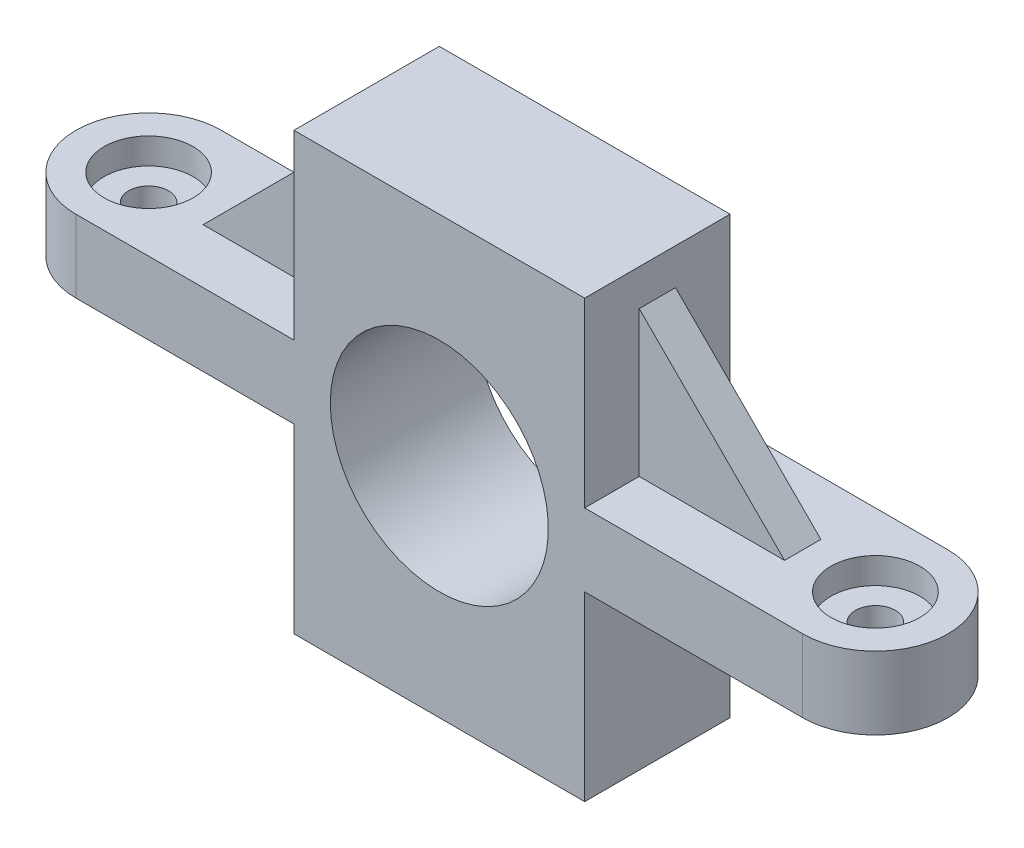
ISO-10303-21;
HEADER;
FILE_DESCRIPTION(('STEP AP214'),'2;1');
FILE_NAME('part.step','',(''),(''),'','','');
FILE_SCHEMA(('AUTOMOTIVE_DESIGN { 1 0 10303 214 1 1 1 1 }'));
ENDSEC;
DATA;
#1=APPLICATION_CONTEXT('core data for automotive mechanical design processes');
#2=APPLICATION_PROTOCOL_DEFINITION('international standard','automotive_design',2000,#1);
#3=PRODUCT_CONTEXT('',#1,'mechanical');
#4=PRODUCT('Part','Part','',(#3));
#5=PRODUCT_RELATED_PRODUCT_CATEGORY('part','',(#4));
#6=PRODUCT_DEFINITION_FORMATION('','',#4);
#7=PRODUCT_DEFINITION_CONTEXT('part definition',#1,'design');
#8=PRODUCT_DEFINITION('design','',#6,#7);
#9=PRODUCT_DEFINITION_SHAPE('','',#8);
#10=(LENGTH_UNIT() NAMED_UNIT(*) SI_UNIT(.MILLI.,.METRE.));
#11=(NAMED_UNIT(*) PLANE_ANGLE_UNIT() SI_UNIT($,.RADIAN.));
#12=(NAMED_UNIT(*) SI_UNIT($,.STERADIAN.) SOLID_ANGLE_UNIT());
#13=UNCERTAINTY_MEASURE_WITH_UNIT(LENGTH_MEASURE(1.E-05),#10,'distance_accuracy_value','');
#14=(GEOMETRIC_REPRESENTATION_CONTEXT(3) GLOBAL_UNCERTAINTY_ASSIGNED_CONTEXT((#13)) GLOBAL_UNIT_ASSIGNED_CONTEXT((#10,
#11,#12)) REPRESENTATION_CONTEXT('',''));
#15=CARTESIAN_POINT('',(0.,0.,0.));
#16=DIRECTION('',(0.,0.,1.));
#17=DIRECTION('',(1.,0.,0.));
#18=AXIS2_PLACEMENT_3D('',#15,#16,#17);
#19=CARTESIAN_POINT('',(-50.,5.,0.));
#20=DIRECTION('',(0.,-1.,0.));
#21=DIRECTION('',(0.,0.,-1.));
#22=AXIS2_PLACEMENT_3D('',#19,#20,#21);
#23=CYLINDRICAL_SURFACE('',#22,10.);
#24=DIRECTION('',(0.,-1.,0.));
#25=VECTOR('',#24,1.);
#26=CARTESIAN_POINT('',(-50.,0.,10.));
#27=LINE('',#26,#25);
#28=CARTESIAN_POINT('',(-50.,5.,10.));
#29=VERTEX_POINT('',#28);
#30=CARTESIAN_POINT('',(-50.,-5.,10.));
#31=VERTEX_POINT('',#30);
#32=EDGE_CURVE('E316',#29,#31,#27,.T.);
#33=ORIENTED_EDGE('',*,*,#32,.F.);
#34=CARTESIAN_POINT('',(-50.,5.,0.));
#35=DIRECTION('',(0.,-1.,0.));
#36=DIRECTION('',(0.,0.,-1.));
#37=AXIS2_PLACEMENT_3D('',#34,#35,#36);
#38=CIRCLE('',#37,10.);
#39=CARTESIAN_POINT('',(-50.,5.,-10.));
#40=VERTEX_POINT('',#39);
#41=EDGE_CURVE('E11',#40,#29,#38,.F.);
#42=ORIENTED_EDGE('',*,*,#41,.F.);
#43=DIRECTION('',(0.,1.,0.));
#44=VECTOR('',#43,1.);
#45=CARTESIAN_POINT('',(-50.,5.,-10.));
#46=LINE('',#45,#44);
#47=CARTESIAN_POINT('',(-50.,-5.,-10.));
#48=VERTEX_POINT('',#47);
#49=EDGE_CURVE('E41',#48,#40,#46,.T.);
#50=ORIENTED_EDGE('',*,*,#49,.F.);
#51=CARTESIAN_POINT('',(-50.,-5.,0.));
#52=DIRECTION('',(0.,-1.,0.));
#53=DIRECTION('',(0.,0.,-1.));
#54=AXIS2_PLACEMENT_3D('',#51,#52,#53);
#55=CIRCLE('',#54,10.);
#56=EDGE_CURVE('E262',#48,#31,#55,.F.);
#57=ORIENTED_EDGE('',*,*,#56,.T.);
#58=EDGE_LOOP('',(#33,#42,#50,#57));
#59=FACE_BOUND('',#58,.T.);
#60=ADVANCED_FACE('F33',(#59),#23,.T.);
#61=CARTESIAN_POINT('',(0.,0.,10.));
#62=DIRECTION('',(0.,0.,-1.));
#63=DIRECTION('',(-1.,0.,0.));
#64=AXIS2_PLACEMENT_3D('',#61,#62,#63);
#65=CYLINDRICAL_SURFACE('',#64,15.);
#66=CARTESIAN_POINT('',(0.,0.,10.));
#67=DIRECTION('',(0.,0.,-1.));
#68=DIRECTION('',(-1.,0.,0.));
#69=AXIS2_PLACEMENT_3D('',#66,#67,#68);
#70=CIRCLE('',#69,15.);
#71=CARTESIAN_POINT('',(-15.,0.,10.));
#72=VERTEX_POINT('',#71);
#73=EDGE_CURVE('E301',#72,#72,#70,.T.);
#74=ORIENTED_EDGE('',*,*,#73,.F.);
#75=EDGE_LOOP('',(#74));
#76=FACE_BOUND('',#75,.T.);
#77=CARTESIAN_POINT('',(0.,0.,-10.));
#78=DIRECTION('',(0.,0.,-1.));
#79=DIRECTION('',(-1.,0.,0.));
#80=AXIS2_PLACEMENT_3D('',#77,#78,#79);
#81=CIRCLE('',#80,15.);
#82=CARTESIAN_POINT('',(-15.,0.,-10.));
#83=VERTEX_POINT('',#82);
#84=EDGE_CURVE('E289',#83,#83,#81,.T.);
#85=ORIENTED_EDGE('',*,*,#84,.T.);
#86=EDGE_LOOP('',(#85));
#87=FACE_BOUND('',#86,.T.);
#88=ADVANCED_FACE('F410',(#76,#87),#65,.F.);
#89=CARTESIAN_POINT('',(-20.,30.,10.));
#90=DIRECTION('',(0.,-1.,0.));
#91=DIRECTION('',(0.,0.,-1.));
#92=AXIS2_PLACEMENT_3D('',#89,#90,#91);
#93=PLANE('',#92);
#94=DIRECTION('',(0.,0.,-1.));
#95=VECTOR('',#94,1.);
#96=CARTESIAN_POINT('',(20.,30.,10.));
#97=LINE('',#96,#95);
#98=CARTESIAN_POINT('',(20.,30.,10.));
#99=VERTEX_POINT('',#98);
#100=CARTESIAN_POINT('',(20.,30.,-10.));
#101=VERTEX_POINT('',#100);
#102=EDGE_CURVE('E279',#99,#101,#97,.T.);
#103=ORIENTED_EDGE('',*,*,#102,.T.);
#104=DIRECTION('',(-1.,0.,0.));
#105=VECTOR('',#104,1.);
#106=CARTESIAN_POINT('',(-20.,30.,-10.));
#107=LINE('',#106,#105);
#108=CARTESIAN_POINT('',(-20.,30.,-10.));
#109=VERTEX_POINT('',#108);
#110=EDGE_CURVE('E292',#101,#109,#107,.T.);
#111=ORIENTED_EDGE('',*,*,#110,.T.);
#112=DIRECTION('',(0.,0.,-1.));
#113=VECTOR('',#112,1.);
#114=CARTESIAN_POINT('',(-20.,30.,10.));
#115=LINE('',#114,#113);
#116=CARTESIAN_POINT('',(-20.,30.,10.));
#117=VERTEX_POINT('',#116);
#118=EDGE_CURVE('E314',#117,#109,#115,.T.);
#119=ORIENTED_EDGE('',*,*,#118,.F.);
#120=DIRECTION('',(-1.,0.,0.));
#121=VECTOR('',#120,1.);
#122=CARTESIAN_POINT('',(-20.,30.,10.));
#123=LINE('',#122,#121);
#124=EDGE_CURVE('E304',#99,#117,#123,.T.);
#125=ORIENTED_EDGE('',*,*,#124,.F.);
#126=EDGE_LOOP('',(#103,#111,#119,#125));
#127=FACE_BOUND('',#126,.T.);
#128=ADVANCED_FACE('F386',(#127),#93,.F.);
#129=CARTESIAN_POINT('',(-20.,5.,10.));
#130=DIRECTION('',(1.,0.,0.));
#131=DIRECTION('',(0.,1.,0.));
#132=AXIS2_PLACEMENT_3D('',#129,#130,#131);
#133=PLANE('',#132);
#134=DIRECTION('',(0.,0.,1.));
#135=VECTOR('',#134,1.);
#136=CARTESIAN_POINT('',(-20.,25.0000000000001,10.));
#137=LINE('',#136,#135);
#138=CARTESIAN_POINT('',(-20.,25.0000000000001,-2.5));
#139=VERTEX_POINT('',#138);
#140=CARTESIAN_POINT('',(-20.,25.0000000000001,2.5));
#141=VERTEX_POINT('',#140);
#142=EDGE_CURVE('E49',#139,#141,#137,.T.);
#143=ORIENTED_EDGE('',*,*,#142,.T.);
#144=DIRECTION('',(0.,-1.,0.));
#145=VECTOR('',#144,1.);
#146=CARTESIAN_POINT('',(-20.,5.,2.5));
#147=LINE('',#146,#145);
#148=CARTESIAN_POINT('',(-20.,5.,2.5));
#149=VERTEX_POINT('',#148);
#150=EDGE_CURVE('E167',#141,#149,#147,.T.);
#151=ORIENTED_EDGE('',*,*,#150,.T.);
#152=DIRECTION('',(0.,0.,-1.));
#153=VECTOR('',#152,1.);
#154=CARTESIAN_POINT('',(-20.,5.,10.));
#155=LINE('',#154,#153);
#156=CARTESIAN_POINT('',(-20.,5.,10.));
#157=VERTEX_POINT('',#156);
#158=EDGE_CURVE('E312',#157,#149,#155,.T.);
#159=ORIENTED_EDGE('',*,*,#158,.F.);
#160=DIRECTION('',(0.,-1.,0.));
#161=VECTOR('',#160,1.);
#162=CARTESIAN_POINT('',(-20.,5.,10.));
#163=LINE('',#162,#161);
#164=EDGE_CURVE('E306',#117,#157,#163,.T.);
#165=ORIENTED_EDGE('',*,*,#164,.F.);
#166=ORIENTED_EDGE('',*,*,#118,.T.);
#167=DIRECTION('',(0.,-1.,0.));
#168=VECTOR('',#167,1.);
#169=CARTESIAN_POINT('',(-20.,5.,-10.));
#170=LINE('',#169,#168);
#171=CARTESIAN_POINT('',(-20.,5.,-10.));
#172=VERTEX_POINT('',#171);
#173=EDGE_CURVE('E295',#109,#172,#170,.T.);
#174=ORIENTED_EDGE('',*,*,#173,.T.);
#175=CARTESIAN_POINT('',(-20.,5.,-2.5));
#176=VERTEX_POINT('',#175);
#177=EDGE_CURVE('E311',#176,#172,#155,.T.);
#178=ORIENTED_EDGE('',*,*,#177,.F.);
#179=DIRECTION('',(0.,-1.,0.));
#180=VECTOR('',#179,1.);
#181=CARTESIAN_POINT('',(-20.,5.,-2.5));
#182=LINE('',#181,#180);
#183=EDGE_CURVE('E54',#139,#176,#182,.T.);
#184=ORIENTED_EDGE('',*,*,#183,.F.);
#185=EDGE_LOOP('',(#143,#151,#159,#165,#166,#174,#178,#184));
#186=FACE_BOUND('',#185,.T.);
#187=ADVANCED_FACE('F388',(#186),#133,.F.);
#188=CARTESIAN_POINT('',(-60.,5.,10.));
#189=DIRECTION('',(0.,-1.,0.));
#190=DIRECTION('',(0.,0.,-1.));
#191=AXIS2_PLACEMENT_3D('',#188,#189,#190);
#192=PLANE('',#191);
#193=CARTESIAN_POINT('',(-50.,4.99999999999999,0.));
#194=DIRECTION('',(0.,1.,0.));
#195=DIRECTION('',(0.,0.,1.));
#196=AXIS2_PLACEMENT_3D('',#193,#194,#195);
#197=CIRCLE('',#196,6.12);
#198=CARTESIAN_POINT('',(-50.,4.99999999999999,6.12));
#199=VERTEX_POINT('',#198);
#200=EDGE_CURVE('E183',#199,#199,#197,.T.);
#201=ORIENTED_EDGE('',*,*,#200,.F.);
#202=EDGE_LOOP('',(#201));
#203=FACE_BOUND('',#202,.T.);
#204=ORIENTED_EDGE('',*,*,#158,.T.);
#205=DIRECTION('',(-1.,0.,0.));
#206=VECTOR('',#205,1.);
#207=CARTESIAN_POINT('',(-60.,5.,2.5));
#208=LINE('',#207,#206);
#209=CARTESIAN_POINT('',(-40.,5.,2.5));
#210=VERTEX_POINT('',#209);
#211=EDGE_CURVE('E162',#149,#210,#208,.T.);
#212=ORIENTED_EDGE('',*,*,#211,.T.);
#213=DIRECTION('',(0.,0.,-1.));
#214=VECTOR('',#213,1.);
#215=CARTESIAN_POINT('',(-40.,5.,10.));
#216=LINE('',#215,#214);
#217=CARTESIAN_POINT('',(-40.,5.,-2.5));
#218=VERTEX_POINT('',#217);
#219=EDGE_CURVE('E156',#210,#218,#216,.T.);
#220=ORIENTED_EDGE('',*,*,#219,.T.);
#221=DIRECTION('',(-1.,0.,0.));
#222=VECTOR('',#221,1.);
#223=CARTESIAN_POINT('',(-60.,5.,-2.5));
#224=LINE('',#223,#222);
#225=EDGE_CURVE('E160',#176,#218,#224,.T.);
#226=ORIENTED_EDGE('',*,*,#225,.F.);
#227=ORIENTED_EDGE('',*,*,#177,.T.);
#228=DIRECTION('',(-1.,0.,0.));
#229=VECTOR('',#228,1.);
#230=CARTESIAN_POINT('',(-60.,5.,-10.));
#231=LINE('',#230,#229);
#232=EDGE_CURVE('E298',#172,#40,#231,.T.);
#233=ORIENTED_EDGE('',*,*,#232,.T.);
#234=ORIENTED_EDGE('',*,*,#41,.T.);
#235=DIRECTION('',(-1.,0.,0.));
#236=VECTOR('',#235,1.);
#237=CARTESIAN_POINT('',(-60.,5.,10.));
#238=LINE('',#237,#236);
#239=EDGE_CURVE('E308',#157,#29,#238,.T.);
#240=ORIENTED_EDGE('',*,*,#239,.F.);
#241=EDGE_LOOP('',(#204,#212,#220,#226,#227,#233,#234,#240));
#242=FACE_BOUND('',#241,.T.);
#243=ADVANCED_FACE('F159',(#203,#242),#192,.F.);
#244=CARTESIAN_POINT('',(0.,0.,10.));
#245=DIRECTION('',(0.,0.,-1.));
#246=DIRECTION('',(-1.,0.,0.));
#247=AXIS2_PLACEMENT_3D('',#244,#245,#246);
#248=PLANE('',#247);
#249=ORIENTED_EDGE('',*,*,#73,.T.);
#250=EDGE_LOOP('',(#249));
#251=FACE_BOUND('',#250,.T.);
#252=ORIENTED_EDGE('',*,*,#239,.T.);
#253=ORIENTED_EDGE('',*,*,#32,.T.);
#254=DIRECTION('',(-1.,0.,0.));
#255=VECTOR('',#254,1.);
#256=CARTESIAN_POINT('',(-60.,-5.,10.));
#257=LINE('',#256,#255);
#258=CARTESIAN_POINT('',(-20.,-5.,10.));
#259=VERTEX_POINT('',#258);
#260=EDGE_CURVE('E255',#259,#31,#257,.T.);
#261=ORIENTED_EDGE('',*,*,#260,.F.);
#262=DIRECTION('',(0.,1.,0.));
#263=VECTOR('',#262,1.);
#264=CARTESIAN_POINT('',(-20.,-5.,10.));
#265=LINE('',#264,#263);
#266=CARTESIAN_POINT('',(-20.,-30.,10.));
#267=VERTEX_POINT('',#266);
#268=EDGE_CURVE('E252',#267,#259,#265,.T.);
#269=ORIENTED_EDGE('',*,*,#268,.F.);
#270=DIRECTION('',(-1.,0.,0.));
#271=VECTOR('',#270,1.);
#272=CARTESIAN_POINT('',(-20.,-30.,10.));
#273=LINE('',#272,#271);
#274=CARTESIAN_POINT('',(20.,-30.,10.));
#275=VERTEX_POINT('',#274);
#276=EDGE_CURVE('E249',#275,#267,#273,.T.);
#277=ORIENTED_EDGE('',*,*,#276,.F.);
#278=DIRECTION('',(0.,1.,0.));
#279=VECTOR('',#278,1.);
#280=CARTESIAN_POINT('',(20.,-5.,10.));
#281=LINE('',#280,#279);
#282=CARTESIAN_POINT('',(20.,-5.,10.));
#283=VERTEX_POINT('',#282);
#284=EDGE_CURVE('E228',#275,#283,#281,.T.);
#285=ORIENTED_EDGE('',*,*,#284,.T.);
#286=DIRECTION('',(1.,0.,0.));
#287=VECTOR('',#286,1.);
#288=CARTESIAN_POINT('',(60.,-5.00000000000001,10.));
#289=LINE('',#288,#287);
#290=CARTESIAN_POINT('',(50.,-5.00000000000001,10.));
#291=VERTEX_POINT('',#290);
#292=EDGE_CURVE('E231',#283,#291,#289,.T.);
#293=ORIENTED_EDGE('',*,*,#292,.T.);
#294=DIRECTION('',(0.,-1.,0.));
#295=VECTOR('',#294,1.);
#296=CARTESIAN_POINT('',(50.,0.,10.));
#297=LINE('',#296,#295);
#298=CARTESIAN_POINT('',(50.,5.00000000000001,10.));
#299=VERTEX_POINT('',#298);
#300=EDGE_CURVE('E281',#299,#291,#297,.T.);
#301=ORIENTED_EDGE('',*,*,#300,.F.);
#302=DIRECTION('',(1.,0.,0.));
#303=VECTOR('',#302,1.);
#304=CARTESIAN_POINT('',(60.,5.00000000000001,10.));
#305=LINE('',#304,#303);
#306=CARTESIAN_POINT('',(20.,5.,10.));
#307=VERTEX_POINT('',#306);
#308=EDGE_CURVE('E272',#307,#299,#305,.T.);
#309=ORIENTED_EDGE('',*,*,#308,.F.);
#310=DIRECTION('',(0.,-1.,0.));
#311=VECTOR('',#310,1.);
#312=CARTESIAN_POINT('',(20.,5.,10.));
#313=LINE('',#312,#311);
#314=EDGE_CURVE('E269',#99,#307,#313,.T.);
#315=ORIENTED_EDGE('',*,*,#314,.F.);
#316=ORIENTED_EDGE('',*,*,#124,.T.);
#317=ORIENTED_EDGE('',*,*,#164,.T.);
#318=EDGE_LOOP('',(#252,#253,#261,#269,#277,#285,#293,#301,#309,#315,#316,#317));
#319=FACE_BOUND('',#318,.T.);
#320=ADVANCED_FACE('F357',(#251,#319),#248,.F.);
#321=CARTESIAN_POINT('',(0.,0.,-10.));
#322=DIRECTION('',(0.,0.,-1.));
#323=DIRECTION('',(-1.,0.,0.));
#324=AXIS2_PLACEMENT_3D('',#321,#322,#323);
#325=PLANE('',#324);
#326=ORIENTED_EDGE('',*,*,#84,.F.);
#327=EDGE_LOOP('',(#326));
#328=FACE_BOUND('',#327,.T.);
#329=DIRECTION('',(-1.,0.,0.));
#330=VECTOR('',#329,1.);
#331=CARTESIAN_POINT('',(-60.,-5.,-10.));
#332=LINE('',#331,#330);
#333=CARTESIAN_POINT('',(-20.,-5.,-10.));
#334=VERTEX_POINT('',#333);
#335=EDGE_CURVE('E246',#334,#48,#332,.T.);
#336=ORIENTED_EDGE('',*,*,#335,.T.);
#337=ORIENTED_EDGE('',*,*,#49,.T.);
#338=ORIENTED_EDGE('',*,*,#232,.F.);
#339=ORIENTED_EDGE('',*,*,#173,.F.);
#340=ORIENTED_EDGE('',*,*,#110,.F.);
#341=DIRECTION('',(0.,-1.,0.));
#342=VECTOR('',#341,1.);
#343=CARTESIAN_POINT('',(20.,5.,-10.));
#344=LINE('',#343,#342);
#345=CARTESIAN_POINT('',(20.,5.,-10.));
#346=VERTEX_POINT('',#345);
#347=EDGE_CURVE('E264',#101,#346,#344,.T.);
#348=ORIENTED_EDGE('',*,*,#347,.T.);
#349=DIRECTION('',(1.,0.,0.));
#350=VECTOR('',#349,1.);
#351=CARTESIAN_POINT('',(60.,5.00000000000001,-10.));
#352=LINE('',#351,#350);
#353=CARTESIAN_POINT('',(50.,5.00000000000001,-10.));
#354=VERTEX_POINT('',#353);
#355=EDGE_CURVE('E267',#346,#354,#352,.T.);
#356=ORIENTED_EDGE('',*,*,#355,.T.);
#357=DIRECTION('',(0.,1.,0.));
#358=VECTOR('',#357,1.);
#359=CARTESIAN_POINT('',(50.,5.00000000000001,-10.));
#360=LINE('',#359,#358);
#361=CARTESIAN_POINT('',(50.,-5.00000000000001,-10.));
#362=VERTEX_POINT('',#361);
#363=EDGE_CURVE('E284',#362,#354,#360,.T.);
#364=ORIENTED_EDGE('',*,*,#363,.F.);
#365=DIRECTION('',(1.,0.,0.));
#366=VECTOR('',#365,1.);
#367=CARTESIAN_POINT('',(60.,-5.00000000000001,-10.));
#368=LINE('',#367,#366);
#369=CARTESIAN_POINT('',(20.,-5.,-10.));
#370=VERTEX_POINT('',#369);
#371=EDGE_CURVE('E225',#370,#362,#368,.T.);
#372=ORIENTED_EDGE('',*,*,#371,.F.);
#373=DIRECTION('',(0.,1.,0.));
#374=VECTOR('',#373,1.);
#375=CARTESIAN_POINT('',(20.,-5.,-10.));
#376=LINE('',#375,#374);
#377=CARTESIAN_POINT('',(20.,-30.,-10.));
#378=VERTEX_POINT('',#377);
#379=EDGE_CURVE('E222',#378,#370,#376,.T.);
#380=ORIENTED_EDGE('',*,*,#379,.F.);
#381=DIRECTION('',(-1.,0.,0.));
#382=VECTOR('',#381,1.);
#383=CARTESIAN_POINT('',(-20.,-30.,-10.));
#384=LINE('',#383,#382);
#385=CARTESIAN_POINT('',(-20.,-30.,-10.));
#386=VERTEX_POINT('',#385);
#387=EDGE_CURVE('E240',#378,#386,#384,.T.);
#388=ORIENTED_EDGE('',*,*,#387,.T.);
#389=DIRECTION('',(0.,1.,0.));
#390=VECTOR('',#389,1.);
#391=CARTESIAN_POINT('',(-20.,-5.,-10.));
#392=LINE('',#391,#390);
#393=EDGE_CURVE('E243',#386,#334,#392,.T.);
#394=ORIENTED_EDGE('',*,*,#393,.T.);
#395=EDGE_LOOP('',(#336,#337,#338,#339,#340,#348,#356,#364,#372,#380,#388,#394));
#396=FACE_BOUND('',#395,.T.);
#397=ADVANCED_FACE('F364',(#328,#396),#325,.T.);
#398=CARTESIAN_POINT('',(50.,5.00000000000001,0.));
#399=DIRECTION('',(0.,-1.,0.));
#400=DIRECTION('',(0.,0.,-1.));
#401=AXIS2_PLACEMENT_3D('',#398,#399,#400);
#402=CYLINDRICAL_SURFACE('',#401,10.);
#403=ORIENTED_EDGE('',*,*,#300,.T.);
#404=CARTESIAN_POINT('',(50.,-5.00000000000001,0.));
#405=DIRECTION('',(0.,1.,0.));
#406=DIRECTION('',(0.,0.,-1.));
#407=AXIS2_PLACEMENT_3D('',#404,#405,#406);
#408=CIRCLE('',#407,10.);
#409=EDGE_CURVE('E238',#362,#291,#408,.F.);
#410=ORIENTED_EDGE('',*,*,#409,.F.);
#411=ORIENTED_EDGE('',*,*,#363,.T.);
#412=CARTESIAN_POINT('',(50.,5.00000000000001,0.));
#413=DIRECTION('',(0.,1.,0.));
#414=DIRECTION('',(0.,0.,-1.));
#415=AXIS2_PLACEMENT_3D('',#412,#413,#414);
#416=CIRCLE('',#415,10.);
#417=EDGE_CURVE('E287',#354,#299,#416,.F.);
#418=ORIENTED_EDGE('',*,*,#417,.T.);
#419=EDGE_LOOP('',(#403,#410,#411,#418));
#420=FACE_BOUND('',#419,.T.);
#421=ADVANCED_FACE('F361',(#420),#402,.T.);
#422=CARTESIAN_POINT('',(20.,5.,10.));
#423=DIRECTION('',(-1.,0.,0.));
#424=DIRECTION('',(0.,1.,0.));
#425=AXIS2_PLACEMENT_3D('',#422,#423,#424);
#426=PLANE('',#425);
#427=DIRECTION('',(0.,1.,0.));
#428=VECTOR('',#427,1.);
#429=CARTESIAN_POINT('',(20.,5.,2.5));
#430=LINE('',#429,#428);
#431=CARTESIAN_POINT('',(20.,5.,2.5));
#432=VERTEX_POINT('',#431);
#433=CARTESIAN_POINT('',(20.,25.0000000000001,2.5));
#434=VERTEX_POINT('',#433);
#435=EDGE_CURVE('E206',#432,#434,#430,.T.);
#436=ORIENTED_EDGE('',*,*,#435,.T.);
#437=DIRECTION('',(0.,0.,1.));
#438=VECTOR('',#437,1.);
#439=CARTESIAN_POINT('',(20.,25.0000000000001,10.));
#440=LINE('',#439,#438);
#441=CARTESIAN_POINT('',(20.,25.0000000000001,-2.5));
#442=VERTEX_POINT('',#441);
#443=EDGE_CURVE('E210',#434,#442,#440,.F.);
#444=ORIENTED_EDGE('',*,*,#443,.T.);
#445=DIRECTION('',(0.,1.,0.));
#446=VECTOR('',#445,1.);
#447=CARTESIAN_POINT('',(20.,5.,-2.5));
#448=LINE('',#447,#446);
#449=CARTESIAN_POINT('',(20.,5.,-2.5));
#450=VERTEX_POINT('',#449);
#451=EDGE_CURVE('E201',#450,#442,#448,.T.);
#452=ORIENTED_EDGE('',*,*,#451,.F.);
#453=DIRECTION('',(0.,0.,-1.));
#454=VECTOR('',#453,1.);
#455=CARTESIAN_POINT('',(20.,5.,10.));
#456=LINE('',#455,#454);
#457=EDGE_CURVE('E275',#450,#346,#456,.T.);
#458=ORIENTED_EDGE('',*,*,#457,.T.);
#459=ORIENTED_EDGE('',*,*,#347,.F.);
#460=ORIENTED_EDGE('',*,*,#102,.F.);
#461=ORIENTED_EDGE('',*,*,#314,.T.);
#462=EDGE_CURVE('E276',#307,#432,#456,.T.);
#463=ORIENTED_EDGE('',*,*,#462,.T.);
#464=EDGE_LOOP('',(#436,#444,#452,#458,#459,#460,#461,#463));
#465=FACE_BOUND('',#464,.T.);
#466=ADVANCED_FACE('F349',(#465),#426,.F.);
#467=CARTESIAN_POINT('',(60.,5.00000000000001,10.));
#468=DIRECTION('',(0.,-1.,0.));
#469=DIRECTION('',(0.,0.,-1.));
#470=AXIS2_PLACEMENT_3D('',#467,#468,#469);
#471=PLANE('',#470);
#472=CARTESIAN_POINT('',(50.,4.99999999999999,0.));
#473=DIRECTION('',(0.,1.,0.));
#474=DIRECTION('',(0.,0.,1.));
#475=AXIS2_PLACEMENT_3D('',#472,#473,#474);
#476=CIRCLE('',#475,6.12);
#477=CARTESIAN_POINT('',(50.,4.99999999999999,6.12));
#478=VERTEX_POINT('',#477);
#479=EDGE_CURVE('E212',#478,#478,#476,.T.);
#480=ORIENTED_EDGE('',*,*,#479,.F.);
#481=EDGE_LOOP('',(#480));
#482=FACE_BOUND('',#481,.T.);
#483=ORIENTED_EDGE('',*,*,#308,.T.);
#484=ORIENTED_EDGE('',*,*,#417,.F.);
#485=ORIENTED_EDGE('',*,*,#355,.F.);
#486=ORIENTED_EDGE('',*,*,#457,.F.);
#487=DIRECTION('',(-1.,0.,0.));
#488=VECTOR('',#487,1.);
#489=CARTESIAN_POINT('',(60.,5.00000000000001,-2.5));
#490=LINE('',#489,#488);
#491=CARTESIAN_POINT('',(40.,5.00000000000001,-2.5));
#492=VERTEX_POINT('',#491);
#493=EDGE_CURVE('E198',#492,#450,#490,.T.);
#494=ORIENTED_EDGE('',*,*,#493,.F.);
#495=DIRECTION('',(0.,0.,-1.));
#496=VECTOR('',#495,1.);
#497=CARTESIAN_POINT('',(40.,5.00000000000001,10.));
#498=LINE('',#497,#496);
#499=CARTESIAN_POINT('',(40.,5.00000000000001,2.5));
#500=VERTEX_POINT('',#499);
#501=EDGE_CURVE('E208',#492,#500,#498,.F.);
#502=ORIENTED_EDGE('',*,*,#501,.T.);
#503=DIRECTION('',(-1.,0.,0.));
#504=VECTOR('',#503,1.);
#505=CARTESIAN_POINT('',(60.,5.00000000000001,2.5));
#506=LINE('',#505,#504);
#507=EDGE_CURVE('E204',#500,#432,#506,.T.);
#508=ORIENTED_EDGE('',*,*,#507,.T.);
#509=ORIENTED_EDGE('',*,*,#462,.F.);
#510=EDGE_LOOP('',(#483,#484,#485,#486,#494,#502,#508,#509));
#511=FACE_BOUND('',#510,.T.);
#512=ADVANCED_FACE('F345',(#482,#511),#471,.F.);
#513=CARTESIAN_POINT('',(-20.,-30.,10.));
#514=DIRECTION('',(0.,1.,0.));
#515=DIRECTION('',(0.,0.,-1.));
#516=AXIS2_PLACEMENT_3D('',#513,#514,#515);
#517=PLANE('',#516);
#518=DIRECTION('',(0.,0.,-1.));
#519=VECTOR('',#518,1.);
#520=CARTESIAN_POINT('',(-20.,-30.,10.));
#521=LINE('',#520,#519);
#522=EDGE_CURVE('E260',#267,#386,#521,.T.);
#523=ORIENTED_EDGE('',*,*,#522,.T.);
#524=ORIENTED_EDGE('',*,*,#387,.F.);
#525=DIRECTION('',(0.,0.,-1.));
#526=VECTOR('',#525,1.);
#527=CARTESIAN_POINT('',(20.,-30.,10.));
#528=LINE('',#527,#526);
#529=EDGE_CURVE('E236',#275,#378,#528,.T.);
#530=ORIENTED_EDGE('',*,*,#529,.F.);
#531=ORIENTED_EDGE('',*,*,#276,.T.);
#532=EDGE_LOOP('',(#523,#524,#530,#531));
#533=FACE_BOUND('',#532,.T.);
#534=ADVANCED_FACE('F348',(#533),#517,.F.);
#535=CARTESIAN_POINT('',(-20.,-5.,10.));
#536=DIRECTION('',(1.,0.,0.));
#537=DIRECTION('',(0.,-1.,0.));
#538=AXIS2_PLACEMENT_3D('',#535,#536,#537);
#539=PLANE('',#538);
#540=DIRECTION('',(0.,0.,-1.));
#541=VECTOR('',#540,1.);
#542=CARTESIAN_POINT('',(-20.,-5.,10.));
#543=LINE('',#542,#541);
#544=EDGE_CURVE('E258',#259,#334,#543,.T.);
#545=ORIENTED_EDGE('',*,*,#544,.T.);
#546=ORIENTED_EDGE('',*,*,#393,.F.);
#547=ORIENTED_EDGE('',*,*,#522,.F.);
#548=ORIENTED_EDGE('',*,*,#268,.T.);
#549=EDGE_LOOP('',(#545,#546,#547,#548));
#550=FACE_BOUND('',#549,.T.);
#551=ADVANCED_FACE('F401',(#550),#539,.F.);
#552=CARTESIAN_POINT('',(-60.,-5.,10.));
#553=DIRECTION('',(0.,1.,0.));
#554=DIRECTION('',(0.,0.,-1.));
#555=AXIS2_PLACEMENT_3D('',#552,#553,#554);
#556=PLANE('',#555);
#557=ORIENTED_EDGE('',*,*,#335,.F.);
#558=ORIENTED_EDGE('',*,*,#544,.F.);
#559=ORIENTED_EDGE('',*,*,#260,.T.);
#560=ORIENTED_EDGE('',*,*,#56,.F.);
#561=EDGE_LOOP('',(#557,#558,#559,#560));
#562=FACE_BOUND('',#561,.T.);
#563=CARTESIAN_POINT('',(-50.,-5.,0.));
#564=DIRECTION('',(0.,1.,0.));
#565=DIRECTION('',(0.,0.,1.));
#566=AXIS2_PLACEMENT_3D('',#563,#564,#565);
#567=CIRCLE('',#566,2.75);
#568=CARTESIAN_POINT('',(-50.,-5.,2.75));
#569=VERTEX_POINT('',#568);
#570=EDGE_CURVE('E36',#569,#569,#567,.T.);
#571=ORIENTED_EDGE('',*,*,#570,.T.);
#572=EDGE_LOOP('',(#571));
#573=FACE_BOUND('',#572,.T.);
#574=ADVANCED_FACE('F396',(#562,#573),#556,.F.);
#575=CARTESIAN_POINT('',(20.,-5.,10.));
#576=DIRECTION('',(-1.,0.,0.));
#577=DIRECTION('',(0.,-1.,0.));
#578=AXIS2_PLACEMENT_3D('',#575,#576,#577);
#579=PLANE('',#578);
#580=ORIENTED_EDGE('',*,*,#529,.T.);
#581=ORIENTED_EDGE('',*,*,#379,.T.);
#582=DIRECTION('',(0.,0.,-1.));
#583=VECTOR('',#582,1.);
#584=CARTESIAN_POINT('',(20.,-5.,10.));
#585=LINE('',#584,#583);
#586=EDGE_CURVE('E234',#283,#370,#585,.T.);
#587=ORIENTED_EDGE('',*,*,#586,.F.);
#588=ORIENTED_EDGE('',*,*,#284,.F.);
#589=EDGE_LOOP('',(#580,#581,#587,#588));
#590=FACE_BOUND('',#589,.T.);
#591=ADVANCED_FACE('F407',(#590),#579,.F.);
#592=CARTESIAN_POINT('',(60.,-5.00000000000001,10.));
#593=DIRECTION('',(0.,1.,0.));
#594=DIRECTION('',(0.,0.,-1.));
#595=AXIS2_PLACEMENT_3D('',#592,#593,#594);
#596=PLANE('',#595);
#597=CARTESIAN_POINT('',(50.,-5.00000000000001,0.));
#598=DIRECTION('',(0.,1.,0.));
#599=DIRECTION('',(-1.,0.,0.));
#600=AXIS2_PLACEMENT_3D('',#597,#598,#599);
#601=CIRCLE('',#600,2.75);
#602=CARTESIAN_POINT('',(47.25,-5.00000000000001,0.));
#603=VERTEX_POINT('',#602);
#604=EDGE_CURVE('E221',#603,#603,#601,.T.);
#605=ORIENTED_EDGE('',*,*,#604,.T.);
#606=EDGE_LOOP('',(#605));
#607=FACE_BOUND('',#606,.T.);
#608=ORIENTED_EDGE('',*,*,#586,.T.);
#609=ORIENTED_EDGE('',*,*,#371,.T.);
#610=ORIENTED_EDGE('',*,*,#409,.T.);
#611=ORIENTED_EDGE('',*,*,#292,.F.);
#612=EDGE_LOOP('',(#608,#609,#610,#611));
#613=FACE_BOUND('',#612,.T.);
#614=ADVANCED_FACE('F323',(#607,#613),#596,.F.);
#615=CARTESIAN_POINT('',(50.,4.99999999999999,0.));
#616=DIRECTION('',(0.,1.,0.));
#617=DIRECTION('',(0.,0.,1.));
#618=AXIS2_PLACEMENT_3D('',#615,#616,#617);
#619=CYLINDRICAL_SURFACE('',#618,2.75);
#620=ORIENTED_EDGE('',*,*,#604,.F.);
#621=EDGE_LOOP('',(#620));
#622=FACE_BOUND('',#621,.T.);
#623=CARTESIAN_POINT('',(50.,1.41999999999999,0.));
#624=DIRECTION('',(0.,1.,0.));
#625=DIRECTION('',(0.,0.,1.));
#626=AXIS2_PLACEMENT_3D('',#623,#624,#625);
#627=CIRCLE('',#626,2.75000000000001);
#628=CARTESIAN_POINT('',(50.,1.41999999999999,2.75000000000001));
#629=VERTEX_POINT('',#628);
#630=EDGE_CURVE('E218',#629,#629,#627,.T.);
#631=ORIENTED_EDGE('',*,*,#630,.T.);
#632=EDGE_LOOP('',(#631));
#633=FACE_BOUND('',#632,.T.);
#634=ADVANCED_FACE('F326',(#622,#633),#619,.F.);
#635=CARTESIAN_POINT('',(52.75,1.41999999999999,0.));
#636=DIRECTION('',(0.,-1.,0.));
#637=DIRECTION('',(0.,0.,-1.));
#638=AXIS2_PLACEMENT_3D('',#635,#636,#637);
#639=PLANE('',#638);
#640=ORIENTED_EDGE('',*,*,#630,.F.);
#641=EDGE_LOOP('',(#640));
#642=FACE_BOUND('',#641,.T.);
#643=CARTESIAN_POINT('',(50.,1.41999999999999,0.));
#644=DIRECTION('',(0.,1.,0.));
#645=DIRECTION('',(0.,0.,1.));
#646=AXIS2_PLACEMENT_3D('',#643,#644,#645);
#647=CIRCLE('',#646,6.11999999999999);
#648=CARTESIAN_POINT('',(50.,1.41999999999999,6.11999999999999));
#649=VERTEX_POINT('',#648);
#650=EDGE_CURVE('E215',#649,#649,#647,.T.);
#651=ORIENTED_EDGE('',*,*,#650,.T.);
#652=EDGE_LOOP('',(#651));
#653=FACE_BOUND('',#652,.T.);
#654=ADVANCED_FACE('F329',(#642,#653),#639,.F.);
#655=CARTESIAN_POINT('',(50.,4.99999999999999,0.));
#656=DIRECTION('',(0.,1.,0.));
#657=DIRECTION('',(0.,0.,1.));
#658=AXIS2_PLACEMENT_3D('',#655,#656,#657);
#659=CYLINDRICAL_SURFACE('',#658,6.12);
#660=ORIENTED_EDGE('',*,*,#650,.F.);
#661=EDGE_LOOP('',(#660));
#662=FACE_BOUND('',#661,.T.);
#663=ORIENTED_EDGE('',*,*,#479,.T.);
#664=EDGE_LOOP('',(#663));
#665=FACE_BOUND('',#664,.T.);
#666=ADVANCED_FACE('F335',(#662,#665),#659,.F.);
#667=CARTESIAN_POINT('',(20.,25.0000000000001,0.));
#668=DIRECTION('',(-0.707106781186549,-0.707106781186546,0.));
#669=DIRECTION('',(0.707106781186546,-0.707106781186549,0.));
#670=AXIS2_PLACEMENT_3D('',#667,#668,#669);
#671=PLANE('',#670);
#672=ORIENTED_EDGE('',*,*,#443,.F.);
#673=DIRECTION('',(0.707106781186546,-0.707106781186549,0.));
#674=VECTOR('',#673,1.);
#675=CARTESIAN_POINT('',(20.,25.0000000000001,2.5));
#676=LINE('',#675,#674);
#677=EDGE_CURVE('E195',#434,#500,#676,.T.);
#678=ORIENTED_EDGE('',*,*,#677,.T.);
#679=ORIENTED_EDGE('',*,*,#501,.F.);
#680=DIRECTION('',(0.707106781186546,-0.707106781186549,0.));
#681=VECTOR('',#680,1.);
#682=CARTESIAN_POINT('',(20.,25.0000000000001,-2.5));
#683=LINE('',#682,#681);
#684=EDGE_CURVE('E192',#442,#492,#683,.T.);
#685=ORIENTED_EDGE('',*,*,#684,.F.);
#686=EDGE_LOOP('',(#672,#678,#679,#685));
#687=FACE_BOUND('',#686,.T.);
#688=ADVANCED_FACE('F341',(#687),#671,.F.);
#689=CARTESIAN_POINT('',(0.,0.,2.5));
#690=DIRECTION('',(0.,0.,1.));
#691=DIRECTION('',(1.,0.,0.));
#692=AXIS2_PLACEMENT_3D('',#689,#690,#691);
#693=PLANE('',#692);
#694=ORIENTED_EDGE('',*,*,#435,.F.);
#695=ORIENTED_EDGE('',*,*,#507,.F.);
#696=ORIENTED_EDGE('',*,*,#677,.F.);
#697=EDGE_LOOP('',(#694,#695,#696));
#698=FACE_BOUND('',#697,.T.);
#699=ADVANCED_FACE('F380',(#698),#693,.T.);
#700=CARTESIAN_POINT('',(0.,0.,-2.5));
#701=DIRECTION('',(0.,0.,1.));
#702=DIRECTION('',(1.,0.,0.));
#703=AXIS2_PLACEMENT_3D('',#700,#701,#702);
#704=PLANE('',#703);
#705=ORIENTED_EDGE('',*,*,#493,.T.);
#706=ORIENTED_EDGE('',*,*,#451,.T.);
#707=ORIENTED_EDGE('',*,*,#684,.T.);
#708=EDGE_LOOP('',(#705,#706,#707));
#709=FACE_BOUND('',#708,.T.);
#710=ADVANCED_FACE('F374',(#709),#704,.F.);
#711=CARTESIAN_POINT('',(-50.,4.99999999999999,0.));
#712=DIRECTION('',(0.,1.,0.));
#713=DIRECTION('',(0.,0.,1.));
#714=AXIS2_PLACEMENT_3D('',#711,#712,#713);
#715=CYLINDRICAL_SURFACE('',#714,2.75);
#716=ORIENTED_EDGE('',*,*,#570,.F.);
#717=EDGE_LOOP('',(#716));
#718=FACE_BOUND('',#717,.T.);
#719=CARTESIAN_POINT('',(-50.,1.41999999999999,0.));
#720=DIRECTION('',(0.,1.,0.));
#721=DIRECTION('',(0.,0.,1.));
#722=AXIS2_PLACEMENT_3D('',#719,#720,#721);
#723=CIRCLE('',#722,2.75000000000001);
#724=CARTESIAN_POINT('',(-50.,1.41999999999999,2.75000000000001));
#725=VERTEX_POINT('',#724);
#726=EDGE_CURVE('E189',#725,#725,#723,.T.);
#727=ORIENTED_EDGE('',*,*,#726,.T.);
#728=EDGE_LOOP('',(#727));
#729=FACE_BOUND('',#728,.T.);
#730=ADVANCED_FACE('F453',(#718,#729),#715,.F.);
#731=CARTESIAN_POINT('',(-47.25,1.41999999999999,0.));
#732=DIRECTION('',(0.,-1.,0.));
#733=DIRECTION('',(0.,0.,-1.));
#734=AXIS2_PLACEMENT_3D('',#731,#732,#733);
#735=PLANE('',#734);
#736=ORIENTED_EDGE('',*,*,#726,.F.);
#737=EDGE_LOOP('',(#736));
#738=FACE_BOUND('',#737,.T.);
#739=CARTESIAN_POINT('',(-50.,1.41999999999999,0.));
#740=DIRECTION('',(0.,1.,0.));
#741=DIRECTION('',(0.,0.,1.));
#742=AXIS2_PLACEMENT_3D('',#739,#740,#741);
#743=CIRCLE('',#742,6.11999999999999);
#744=CARTESIAN_POINT('',(-50.,1.41999999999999,6.11999999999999));
#745=VERTEX_POINT('',#744);
#746=EDGE_CURVE('E186',#745,#745,#743,.T.);
#747=ORIENTED_EDGE('',*,*,#746,.T.);
#748=EDGE_LOOP('',(#747));
#749=FACE_BOUND('',#748,.T.);
#750=ADVANCED_FACE('F456',(#738,#749),#735,.F.);
#751=CARTESIAN_POINT('',(-50.,4.99999999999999,0.));
#752=DIRECTION('',(0.,1.,0.));
#753=DIRECTION('',(0.,0.,1.));
#754=AXIS2_PLACEMENT_3D('',#751,#752,#753);
#755=CYLINDRICAL_SURFACE('',#754,6.12);
#756=ORIENTED_EDGE('',*,*,#746,.F.);
#757=EDGE_LOOP('',(#756));
#758=FACE_BOUND('',#757,.T.);
#759=ORIENTED_EDGE('',*,*,#200,.T.);
#760=EDGE_LOOP('',(#759));
#761=FACE_BOUND('',#760,.T.);
#762=ADVANCED_FACE('F460',(#758,#761),#755,.F.);
#763=CARTESIAN_POINT('',(-20.,25.0000000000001,0.));
#764=DIRECTION('',(-0.707106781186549,0.707106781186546,0.));
#765=DIRECTION('',(-0.707106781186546,-0.707106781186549,0.));
#766=AXIS2_PLACEMENT_3D('',#763,#764,#765);
#767=PLANE('',#766);
#768=ORIENTED_EDGE('',*,*,#142,.F.);
#769=DIRECTION('',(-0.707106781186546,-0.707106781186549,0.));
#770=VECTOR('',#769,1.);
#771=CARTESIAN_POINT('',(-20.,25.0000000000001,-2.5));
#772=LINE('',#771,#770);
#773=EDGE_CURVE('E172',#139,#218,#772,.T.);
#774=ORIENTED_EDGE('',*,*,#773,.T.);
#775=ORIENTED_EDGE('',*,*,#219,.F.);
#776=DIRECTION('',(-0.707106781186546,-0.707106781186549,0.));
#777=VECTOR('',#776,1.);
#778=CARTESIAN_POINT('',(-20.,25.0000000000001,2.5));
#779=LINE('',#778,#777);
#780=EDGE_CURVE('E173',#141,#210,#779,.T.);
#781=ORIENTED_EDGE('',*,*,#780,.F.);
#782=EDGE_LOOP('',(#768,#774,#775,#781));
#783=FACE_BOUND('',#782,.T.);
#784=ADVANCED_FACE('F175',(#783),#767,.T.);
#785=CARTESIAN_POINT('',(0.,0.,2.5));
#786=DIRECTION('',(0.,0.,1.));
#787=DIRECTION('',(1.,0.,0.));
#788=AXIS2_PLACEMENT_3D('',#785,#786,#787);
#789=PLANE('',#788);
#790=ORIENTED_EDGE('',*,*,#150,.F.);
#791=ORIENTED_EDGE('',*,*,#780,.T.);
#792=ORIENTED_EDGE('',*,*,#211,.F.);
#793=EDGE_LOOP('',(#790,#791,#792));
#794=FACE_BOUND('',#793,.T.);
#795=ADVANCED_FACE('F467',(#794),#789,.T.);
#796=CARTESIAN_POINT('',(0.,0.,-2.5));
#797=DIRECTION('',(0.,0.,1.));
#798=DIRECTION('',(1.,0.,0.));
#799=AXIS2_PLACEMENT_3D('',#796,#797,#798);
#800=PLANE('',#799);
#801=ORIENTED_EDGE('',*,*,#773,.F.);
#802=ORIENTED_EDGE('',*,*,#183,.T.);
#803=ORIENTED_EDGE('',*,*,#225,.T.);
#804=EDGE_LOOP('',(#801,#802,#803));
#805=FACE_BOUND('',#804,.T.);
#806=ADVANCED_FACE('F171',(#805),#800,.F.);
#807=CLOSED_SHELL('',(#60,#88,#128,#187,#243,#320,#397,#421,#466,#512,#534,#551,#574,#591,#614,
#634,#654,#666,#688,#699,#710,#730,#750,#762,#784,#795,#806));
#808=MANIFOLD_SOLID_BREP('B2',#807);
#809=ADVANCED_BREP_SHAPE_REPRESENTATION('',(#18,#808),#14);
#810=SHAPE_DEFINITION_REPRESENTATION(#9,#809);
ENDSEC;
END-ISO-10303-21;
